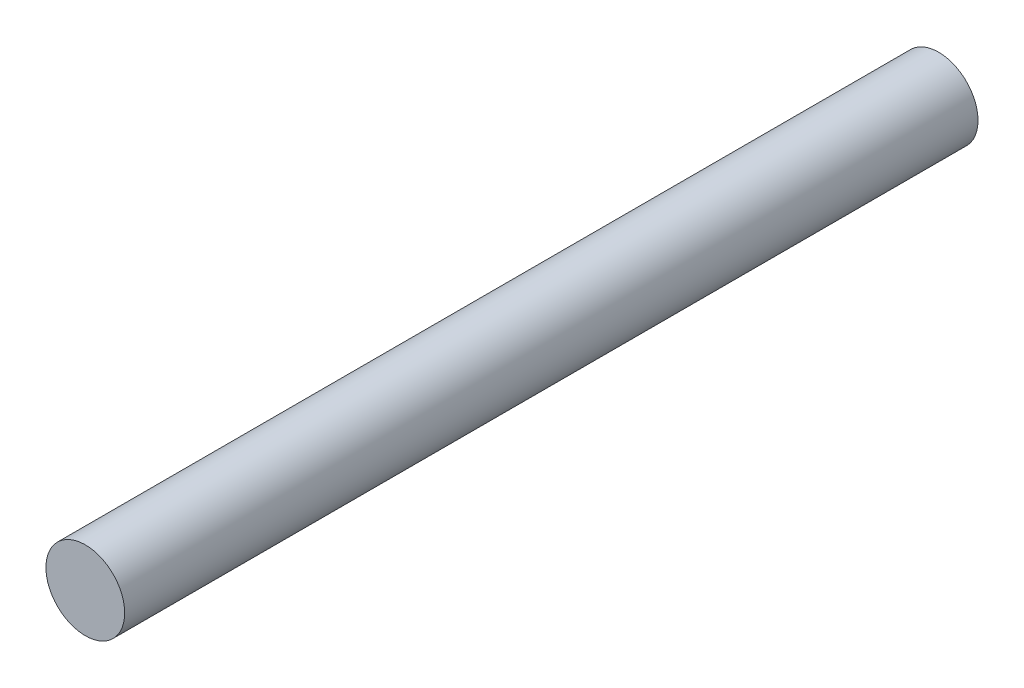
from build123d import *

# Parameters (mm, degrees)
SKETCH1_R           = 30
BOSS_EXTRUDE1_DEPTH = 650


with BuildPart() as part:
    # Sketch1 → Boss-Extrude1 (new body)
    with BuildSketch(Plane.XY):
        Circle(SKETCH1_R)
    extrude(amount=-BOSS_EXTRUDE1_DEPTH)


solid = part.part
